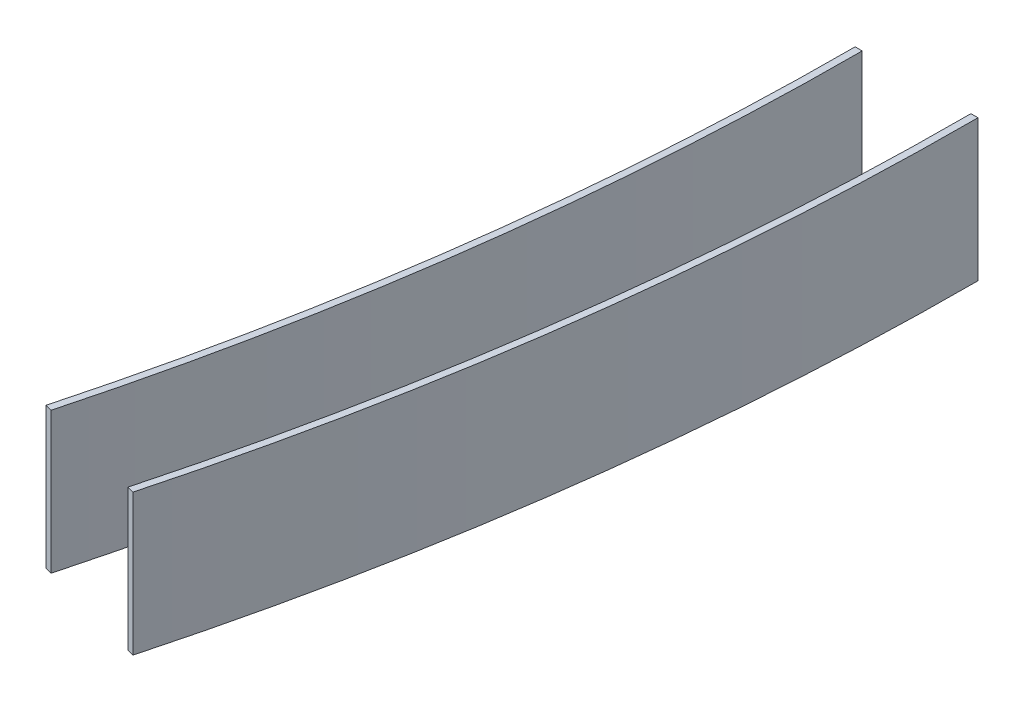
ISO-10303-21;
HEADER;
FILE_DESCRIPTION(('STEP AP214'),'2;1');
FILE_NAME('part.step','',(''),(''),'','','');
FILE_SCHEMA(('AUTOMOTIVE_DESIGN { 1 0 10303 214 1 1 1 1 }'));
ENDSEC;
DATA;
#1=APPLICATION_CONTEXT('core data for automotive mechanical design processes');
#2=APPLICATION_PROTOCOL_DEFINITION('international standard','automotive_design',2000,#1);
#3=PRODUCT_CONTEXT('',#1,'mechanical');
#4=PRODUCT('Part','Part','',(#3));
#5=PRODUCT_RELATED_PRODUCT_CATEGORY('part','',(#4));
#6=PRODUCT_DEFINITION_FORMATION('','',#4);
#7=PRODUCT_DEFINITION_CONTEXT('part definition',#1,'design');
#8=PRODUCT_DEFINITION('design','',#6,#7);
#9=PRODUCT_DEFINITION_SHAPE('','',#8);
#10=(LENGTH_UNIT() NAMED_UNIT(*) SI_UNIT(.MILLI.,.METRE.));
#11=(NAMED_UNIT(*) PLANE_ANGLE_UNIT() SI_UNIT($,.RADIAN.));
#12=(NAMED_UNIT(*) SI_UNIT($,.STERADIAN.) SOLID_ANGLE_UNIT());
#13=UNCERTAINTY_MEASURE_WITH_UNIT(LENGTH_MEASURE(1.E-05),#10,'distance_accuracy_value','');
#14=(GEOMETRIC_REPRESENTATION_CONTEXT(3) GLOBAL_UNCERTAINTY_ASSIGNED_CONTEXT((#13)) GLOBAL_UNIT_ASSIGNED_CONTEXT((#10,
#11,#12)) REPRESENTATION_CONTEXT('',''));
#15=CARTESIAN_POINT('',(0.,0.,0.));
#16=DIRECTION('',(0.,0.,1.));
#17=DIRECTION('',(1.,0.,0.));
#18=AXIS2_PLACEMENT_3D('',#15,#16,#17);
#19=CARTESIAN_POINT('',(0.,44.1101666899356,0.));
#20=DIRECTION('',(0.,1.,0.));
#21=DIRECTION('',(0.,0.,1.));
#22=AXIS2_PLACEMENT_3D('',#19,#20,#21);
#23=CYLINDRICAL_SURFACE('',#22,203.85);
#24=CARTESIAN_POINT('',(0.,-9.74999999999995,0.));
#25=DIRECTION('',(0.,1.,0.));
#26=DIRECTION('',(0.,0.,1.));
#27=AXIS2_PLACEMENT_3D('',#24,#25,#26);
#28=CIRCLE('',#27,203.85);
#29=CARTESIAN_POINT('',(196.903979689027,-9.74999999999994,52.760262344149));
#30=VERTEX_POINT('',#29);
#31=CARTESIAN_POINT('',(203.85,-9.74999999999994,0.));
#32=VERTEX_POINT('',#31);
#33=EDGE_CURVE('E12',#30,#32,#28,.T.);
#34=ORIENTED_EDGE('',*,*,#33,.F.);
#35=DIRECTION('',(0.,-1.,0.));
#36=VECTOR('',#35,1.);
#37=CARTESIAN_POINT('',(196.903979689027,0.,52.760262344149));
#38=LINE('',#37,#36);
#39=CARTESIAN_POINT('',(196.903979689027,0.250000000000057,52.760262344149));
#40=VERTEX_POINT('',#39);
#41=EDGE_CURVE('E108',#40,#30,#38,.T.);
#42=ORIENTED_EDGE('',*,*,#41,.F.);
#43=CARTESIAN_POINT('',(0.,0.250000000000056,0.));
#44=DIRECTION('',(0.,1.,0.));
#45=DIRECTION('',(0.,0.,1.));
#46=AXIS2_PLACEMENT_3D('',#43,#44,#45);
#47=CIRCLE('',#46,203.85);
#48=CARTESIAN_POINT('',(203.85,0.250000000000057,0.));
#49=VERTEX_POINT('',#48);
#50=EDGE_CURVE('E61',#40,#49,#47,.T.);
#51=ORIENTED_EDGE('',*,*,#50,.T.);
#52=DIRECTION('',(0.,-1.,0.));
#53=VECTOR('',#52,1.);
#54=CARTESIAN_POINT('',(203.85,0.,0.));
#55=LINE('',#54,#53);
#56=EDGE_CURVE('E97',#49,#32,#55,.T.);
#57=ORIENTED_EDGE('',*,*,#56,.T.);
#58=EDGE_LOOP('',(#34,#42,#51,#57));
#59=FACE_BOUND('',#58,.T.);
#60=ADVANCED_FACE('F46',(#59),#23,.F.);
#61=CARTESIAN_POINT('',(0.,-9.74999999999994,0.));
#62=DIRECTION('',(0.,1.,0.));
#63=DIRECTION('',(0.,0.,1.));
#64=AXIS2_PLACEMENT_3D('',#61,#62,#63);
#65=PLANE('',#64);
#66=CARTESIAN_POINT('',(0.,-9.74999999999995,0.));
#67=DIRECTION('',(0.,1.,0.));
#68=DIRECTION('',(0.,0.,1.));
#69=AXIS2_PLACEMENT_3D('',#66,#67,#68);
#70=CIRCLE('',#69,204.35);
#71=CARTESIAN_POINT('',(197.386942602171,-9.74999999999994,52.8896718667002));
#72=VERTEX_POINT('',#71);
#73=CARTESIAN_POINT('',(204.35,-9.74999999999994,0.));
#74=VERTEX_POINT('',#73);
#75=EDGE_CURVE('E54',#72,#74,#70,.T.);
#76=ORIENTED_EDGE('',*,*,#75,.F.);
#77=DIRECTION('',(0.965925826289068,0.,0.258819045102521));
#78=VECTOR('',#77,1.);
#79=CARTESIAN_POINT('',(0.,-9.74999999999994,0.));
#80=LINE('',#79,#78);
#81=EDGE_CURVE('E93',#30,#72,#80,.T.);
#82=ORIENTED_EDGE('',*,*,#81,.F.);
#83=ORIENTED_EDGE('',*,*,#33,.T.);
#84=DIRECTION('',(1.,0.,0.));
#85=VECTOR('',#84,1.);
#86=CARTESIAN_POINT('',(0.,-9.74999999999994,0.));
#87=LINE('',#86,#85);
#88=EDGE_CURVE('E90',#32,#74,#87,.T.);
#89=ORIENTED_EDGE('',*,*,#88,.T.);
#90=EDGE_LOOP('',(#76,#82,#83,#89));
#91=FACE_BOUND('',#90,.T.);
#92=ADVANCED_FACE('F48',(#91),#65,.F.);
#93=CARTESIAN_POINT('',(0.,44.1101666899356,0.));
#94=DIRECTION('',(0.,1.,0.));
#95=DIRECTION('',(0.,0.,1.));
#96=AXIS2_PLACEMENT_3D('',#93,#94,#95);
#97=CYLINDRICAL_SURFACE('',#96,204.35);
#98=CARTESIAN_POINT('',(0.,0.250000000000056,0.));
#99=DIRECTION('',(0.,1.,0.));
#100=DIRECTION('',(0.,0.,1.));
#101=AXIS2_PLACEMENT_3D('',#98,#99,#100);
#102=CIRCLE('',#101,204.35);
#103=CARTESIAN_POINT('',(197.386942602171,0.250000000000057,52.8896718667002));
#104=VERTEX_POINT('',#103);
#105=CARTESIAN_POINT('',(204.35,0.250000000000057,0.));
#106=VERTEX_POINT('',#105);
#107=EDGE_CURVE('E69',#104,#106,#102,.T.);
#108=ORIENTED_EDGE('',*,*,#107,.F.);
#109=DIRECTION('',(0.,1.,0.));
#110=VECTOR('',#109,1.);
#111=CARTESIAN_POINT('',(197.386942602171,0.,52.8896718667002));
#112=LINE('',#111,#110);
#113=EDGE_CURVE('E111',#72,#104,#112,.T.);
#114=ORIENTED_EDGE('',*,*,#113,.F.);
#115=ORIENTED_EDGE('',*,*,#75,.T.);
#116=DIRECTION('',(0.,1.,0.));
#117=VECTOR('',#116,1.);
#118=CARTESIAN_POINT('',(204.35,0.,0.));
#119=LINE('',#118,#117);
#120=EDGE_CURVE('E102',#74,#106,#119,.T.);
#121=ORIENTED_EDGE('',*,*,#120,.T.);
#122=EDGE_LOOP('',(#108,#114,#115,#121));
#123=FACE_BOUND('',#122,.T.);
#124=ADVANCED_FACE('F116',(#123),#97,.T.);
#125=CARTESIAN_POINT('',(0.,0.250000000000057,0.));
#126=DIRECTION('',(0.,1.,0.));
#127=DIRECTION('',(0.,0.,1.));
#128=AXIS2_PLACEMENT_3D('',#125,#126,#127);
#129=PLANE('',#128);
#130=DIRECTION('',(0.965925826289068,0.,0.258819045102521));
#131=VECTOR('',#130,1.);
#132=CARTESIAN_POINT('',(0.,0.24999999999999,0.));
#133=LINE('',#132,#131);
#134=EDGE_CURVE('E113',#40,#104,#133,.T.);
#135=ORIENTED_EDGE('',*,*,#134,.T.);
#136=ORIENTED_EDGE('',*,*,#107,.T.);
#137=DIRECTION('',(1.,0.,0.));
#138=VECTOR('',#137,1.);
#139=CARTESIAN_POINT('',(0.,0.24999999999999,0.));
#140=LINE('',#139,#138);
#141=EDGE_CURVE('E104',#49,#106,#140,.T.);
#142=ORIENTED_EDGE('',*,*,#141,.F.);
#143=ORIENTED_EDGE('',*,*,#50,.F.);
#144=EDGE_LOOP('',(#135,#136,#142,#143));
#145=FACE_BOUND('',#144,.T.);
#146=ADVANCED_FACE('F120',(#145),#129,.T.);
#147=CARTESIAN_POINT('',(0.,0.,0.));
#148=DIRECTION('',(-0.258819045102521,0.,0.965925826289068));
#149=DIRECTION('',(0.965925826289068,0.,0.258819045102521));
#150=AXIS2_PLACEMENT_3D('',#147,#148,#149);
#151=PLANE('',#150);
#152=ORIENTED_EDGE('',*,*,#41,.T.);
#153=ORIENTED_EDGE('',*,*,#81,.T.);
#154=ORIENTED_EDGE('',*,*,#113,.T.);
#155=ORIENTED_EDGE('',*,*,#134,.F.);
#156=EDGE_LOOP('',(#152,#153,#154,#155));
#157=FACE_BOUND('',#156,.T.);
#158=ADVANCED_FACE('F118',(#157),#151,.T.);
#159=CARTESIAN_POINT('',(0.,0.,0.));
#160=DIRECTION('',(0.,0.,1.));
#161=DIRECTION('',(1.,0.,0.));
#162=AXIS2_PLACEMENT_3D('',#159,#160,#161);
#163=PLANE('',#162);
#164=ORIENTED_EDGE('',*,*,#56,.F.);
#165=ORIENTED_EDGE('',*,*,#141,.T.);
#166=ORIENTED_EDGE('',*,*,#120,.F.);
#167=ORIENTED_EDGE('',*,*,#88,.F.);
#168=EDGE_LOOP('',(#164,#165,#166,#167));
#169=FACE_BOUND('',#168,.T.);
#170=ADVANCED_FACE('F101',(#169),#163,.F.);
#171=CLOSED_SHELL('',(#60,#92,#124,#146,#158,#170));
#172=MANIFOLD_SOLID_BREP('B2',#171);
#173=CARTESIAN_POINT('',(0.,44.1101666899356,0.));
#174=DIRECTION('',(0.,1.,0.));
#175=DIRECTION('',(0.,0.,1.));
#176=AXIS2_PLACEMENT_3D('',#173,#174,#175);
#177=CYLINDRICAL_SURFACE('',#176,195.65);
#178=CARTESIAN_POINT('',(0.,-9.74999999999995,0.));
#179=DIRECTION('',(0.,1.,0.));
#180=DIRECTION('',(0.,0.,1.));
#181=AXIS2_PLACEMENT_3D('',#178,#179,#180);
#182=CIRCLE('',#181,195.65);
#183=CARTESIAN_POINT('',(188.983387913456,-9.74999999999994,50.6379461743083));
#184=VERTEX_POINT('',#183);
#185=CARTESIAN_POINT('',(195.65,-9.74999999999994,0.));
#186=VERTEX_POINT('',#185);
#187=EDGE_CURVE('E44',#184,#186,#182,.T.);
#188=ORIENTED_EDGE('',*,*,#187,.F.);
#189=DIRECTION('',(0.,-1.,0.));
#190=VECTOR('',#189,1.);
#191=CARTESIAN_POINT('',(188.983387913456,0.,50.6379461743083));
#192=LINE('',#191,#190);
#193=CARTESIAN_POINT('',(188.983387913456,0.250000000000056,50.6379461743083));
#194=VERTEX_POINT('',#193);
#195=EDGE_CURVE('E234',#194,#184,#192,.T.);
#196=ORIENTED_EDGE('',*,*,#195,.F.);
#197=CARTESIAN_POINT('',(0.,0.250000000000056,0.));
#198=DIRECTION('',(0.,1.,0.));
#199=DIRECTION('',(0.,0.,1.));
#200=AXIS2_PLACEMENT_3D('',#197,#198,#199);
#201=CIRCLE('',#200,195.65);
#202=CARTESIAN_POINT('',(195.65,0.250000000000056,0.));
#203=VERTEX_POINT('',#202);
#204=EDGE_CURVE('E187',#194,#203,#201,.T.);
#205=ORIENTED_EDGE('',*,*,#204,.T.);
#206=DIRECTION('',(0.,-1.,0.));
#207=VECTOR('',#206,1.);
#208=CARTESIAN_POINT('',(195.65,0.,0.));
#209=LINE('',#208,#207);
#210=EDGE_CURVE('E223',#203,#186,#209,.T.);
#211=ORIENTED_EDGE('',*,*,#210,.T.);
#212=EDGE_LOOP('',(#188,#196,#205,#211));
#213=FACE_BOUND('',#212,.T.);
#214=ADVANCED_FACE('F172',(#213),#177,.F.);
#215=CARTESIAN_POINT('',(0.,-9.74999999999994,0.));
#216=DIRECTION('',(0.,1.,0.));
#217=DIRECTION('',(0.,0.,1.));
#218=AXIS2_PLACEMENT_3D('',#215,#216,#217);
#219=PLANE('',#218);
#220=CARTESIAN_POINT('',(0.,-9.74999999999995,0.));
#221=DIRECTION('',(0.,1.,0.));
#222=DIRECTION('',(0.,0.,1.));
#223=AXIS2_PLACEMENT_3D('',#220,#221,#222);
#224=CIRCLE('',#223,196.15);
#225=CARTESIAN_POINT('',(189.466350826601,-9.74999999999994,50.7673556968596));
#226=VERTEX_POINT('',#225);
#227=CARTESIAN_POINT('',(196.15,-9.74999999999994,0.));
#228=VERTEX_POINT('',#227);
#229=EDGE_CURVE('E180',#226,#228,#224,.T.);
#230=ORIENTED_EDGE('',*,*,#229,.F.);
#231=DIRECTION('',(0.965925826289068,0.,0.258819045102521));
#232=VECTOR('',#231,1.);
#233=CARTESIAN_POINT('',(0.,-9.74999999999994,0.));
#234=LINE('',#233,#232);
#235=EDGE_CURVE('E219',#184,#226,#234,.T.);
#236=ORIENTED_EDGE('',*,*,#235,.F.);
#237=ORIENTED_EDGE('',*,*,#187,.T.);
#238=DIRECTION('',(1.,0.,0.));
#239=VECTOR('',#238,1.);
#240=CARTESIAN_POINT('',(0.,-9.74999999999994,0.));
#241=LINE('',#240,#239);
#242=EDGE_CURVE('E216',#186,#228,#241,.T.);
#243=ORIENTED_EDGE('',*,*,#242,.T.);
#244=EDGE_LOOP('',(#230,#236,#237,#243));
#245=FACE_BOUND('',#244,.T.);
#246=ADVANCED_FACE('F174',(#245),#219,.F.);
#247=CARTESIAN_POINT('',(0.,44.1101666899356,0.));
#248=DIRECTION('',(0.,1.,0.));
#249=DIRECTION('',(0.,0.,1.));
#250=AXIS2_PLACEMENT_3D('',#247,#248,#249);
#251=CYLINDRICAL_SURFACE('',#250,196.15);
#252=CARTESIAN_POINT('',(0.,0.250000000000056,0.));
#253=DIRECTION('',(0.,1.,0.));
#254=DIRECTION('',(0.,0.,1.));
#255=AXIS2_PLACEMENT_3D('',#252,#253,#254);
#256=CIRCLE('',#255,196.15);
#257=CARTESIAN_POINT('',(189.466350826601,0.250000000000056,50.7673556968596));
#258=VERTEX_POINT('',#257);
#259=CARTESIAN_POINT('',(196.15,0.250000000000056,0.));
#260=VERTEX_POINT('',#259);
#261=EDGE_CURVE('E195',#258,#260,#256,.T.);
#262=ORIENTED_EDGE('',*,*,#261,.F.);
#263=DIRECTION('',(0.,-1.,0.));
#264=VECTOR('',#263,1.);
#265=CARTESIAN_POINT('',(189.466350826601,0.,50.7673556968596));
#266=LINE('',#265,#264);
#267=EDGE_CURVE('E237',#258,#226,#266,.T.);
#268=ORIENTED_EDGE('',*,*,#267,.T.);
#269=ORIENTED_EDGE('',*,*,#229,.T.);
#270=DIRECTION('',(0.,-1.,0.));
#271=VECTOR('',#270,1.);
#272=CARTESIAN_POINT('',(196.15,0.,0.));
#273=LINE('',#272,#271);
#274=EDGE_CURVE('E228',#260,#228,#273,.T.);
#275=ORIENTED_EDGE('',*,*,#274,.F.);
#276=EDGE_LOOP('',(#262,#268,#269,#275));
#277=FACE_BOUND('',#276,.T.);
#278=ADVANCED_FACE('F242',(#277),#251,.T.);
#279=CARTESIAN_POINT('',(0.,0.250000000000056,0.));
#280=DIRECTION('',(0.,1.,0.));
#281=DIRECTION('',(0.,0.,1.));
#282=AXIS2_PLACEMENT_3D('',#279,#280,#281);
#283=PLANE('',#282);
#284=DIRECTION('',(0.965925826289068,0.,0.258819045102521));
#285=VECTOR('',#284,1.);
#286=CARTESIAN_POINT('',(0.,0.250000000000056,0.));
#287=LINE('',#286,#285);
#288=EDGE_CURVE('E239',#194,#258,#287,.T.);
#289=ORIENTED_EDGE('',*,*,#288,.T.);
#290=ORIENTED_EDGE('',*,*,#261,.T.);
#291=DIRECTION('',(1.,0.,0.));
#292=VECTOR('',#291,1.);
#293=CARTESIAN_POINT('',(0.,0.250000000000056,0.));
#294=LINE('',#293,#292);
#295=EDGE_CURVE('E230',#203,#260,#294,.T.);
#296=ORIENTED_EDGE('',*,*,#295,.F.);
#297=ORIENTED_EDGE('',*,*,#204,.F.);
#298=EDGE_LOOP('',(#289,#290,#296,#297));
#299=FACE_BOUND('',#298,.T.);
#300=ADVANCED_FACE('F246',(#299),#283,.T.);
#301=CARTESIAN_POINT('',(0.,0.,0.));
#302=DIRECTION('',(-0.258819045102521,0.,0.965925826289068));
#303=DIRECTION('',(0.965925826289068,0.,0.258819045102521));
#304=AXIS2_PLACEMENT_3D('',#301,#302,#303);
#305=PLANE('',#304);
#306=ORIENTED_EDGE('',*,*,#195,.T.);
#307=ORIENTED_EDGE('',*,*,#235,.T.);
#308=ORIENTED_EDGE('',*,*,#267,.F.);
#309=ORIENTED_EDGE('',*,*,#288,.F.);
#310=EDGE_LOOP('',(#306,#307,#308,#309));
#311=FACE_BOUND('',#310,.T.);
#312=ADVANCED_FACE('F244',(#311),#305,.T.);
#313=CARTESIAN_POINT('',(0.,0.,0.));
#314=DIRECTION('',(0.,0.,1.));
#315=DIRECTION('',(1.,0.,0.));
#316=AXIS2_PLACEMENT_3D('',#313,#314,#315);
#317=PLANE('',#316);
#318=ORIENTED_EDGE('',*,*,#210,.F.);
#319=ORIENTED_EDGE('',*,*,#295,.T.);
#320=ORIENTED_EDGE('',*,*,#274,.T.);
#321=ORIENTED_EDGE('',*,*,#242,.F.);
#322=EDGE_LOOP('',(#318,#319,#320,#321));
#323=FACE_BOUND('',#322,.T.);
#324=ADVANCED_FACE('F227',(#323),#317,.F.);
#325=CLOSED_SHELL('',(#214,#246,#278,#300,#312,#324));
#326=MANIFOLD_SOLID_BREP('B6',#325);
#327=ADVANCED_BREP_SHAPE_REPRESENTATION('',(#18,#172,#326),#14);
#328=SHAPE_DEFINITION_REPRESENTATION(#9,#327);
ENDSEC;
END-ISO-10303-21;
